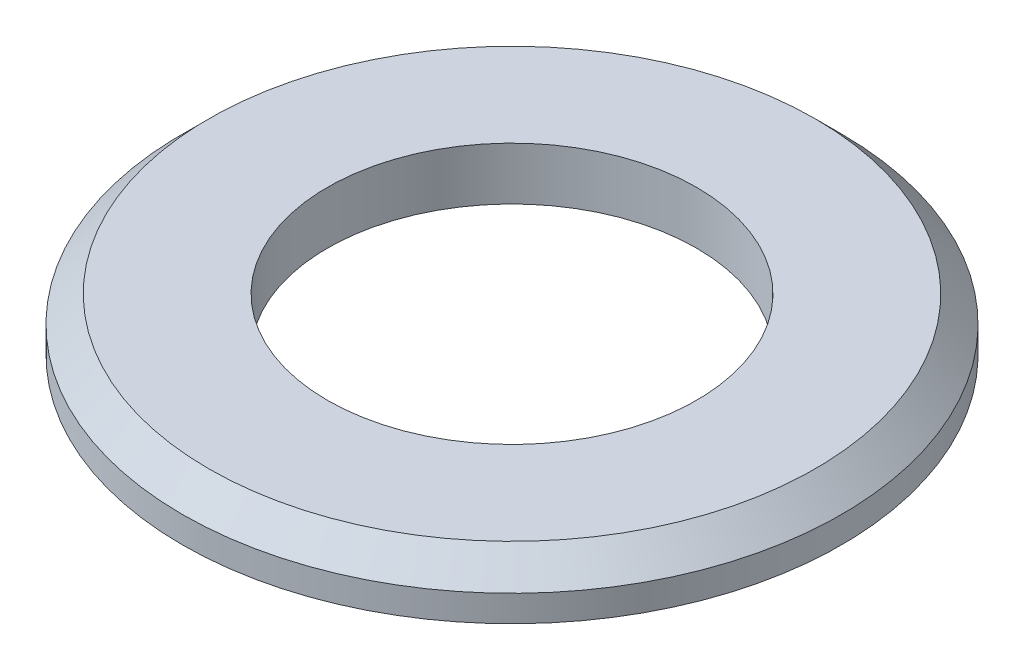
from build123d import *

# Parameters (mm, degrees)
SKETCH1_R      = 25
SKETCH1_R_2    = 14
EXTRUDE1_DEPTH = 4
CHAMFER1_SIZE  = 2


with BuildPart() as part:
    # Sketch1 → Extrude1 (new body)
    with BuildSketch(Plane(origin=(0, 0, 0), x_dir=(1, 0, 0), z_dir=(0, 1, 0))):
        with Locations(Location((0, 0, 0), (0, 0, 270))):
            Circle(SKETCH1_R)
        with Locations(Location((0, 0, 0), (0, 0, 270))):
            Circle(SKETCH1_R_2, mode=Mode.SUBTRACT)
    extrude(amount=EXTRUDE1_DEPTH)

    # Chamfer1
    chamfer1_edges = [part.edges().sort_by_distance(p)[0] for p in [
        (0, 4, -25),
    ]]
    chamfer(chamfer1_edges, length=CHAMFER1_SIZE)


solid = part.part
